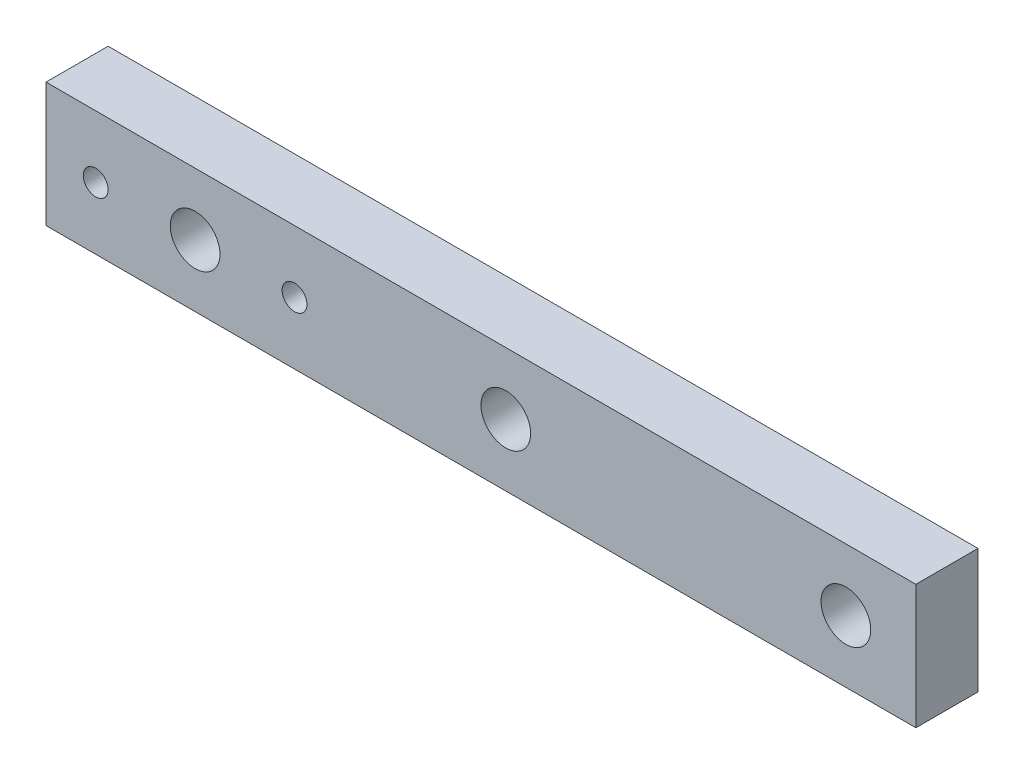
from build123d import *

# Parameters (mm, degrees)
SKETCH1_W           = 70
SKETCH1_H           = 10
BOSS_EXTRUDE1_DEPTH = 5
SKETCH2_R           = 1
SKETCH2_R_2         = 2
CUT_EXTRUDE1_DEPTH  = 5


with BuildPart() as part:
    # Sketch1 → Boss-Extrude1 (new body)
    with BuildSketch(Plane.XY):
        with Locations((2, 0)):
            Rectangle(SKETCH1_W, SKETCH1_H)
    extrude(amount=BOSS_EXTRUDE1_DEPTH)

    # Sketch2 → Cut-Extrude1 (cut)
    with BuildSketch(Plane.XY.offset(5)):
        with Locations((-29, 0)):
            Circle(SKETCH2_R)
        with Locations((-21, 0)):
            Circle(SKETCH2_R_2)
        with Locations((-13, 0)):
            Circle(SKETCH2_R)
        with Locations((4, 0)):
            Circle(SKETCH2_R_2)
        with Locations((31.367, 0)):
            Circle(SKETCH2_R_2)
    extrude(amount=-CUT_EXTRUDE1_DEPTH, mode=Mode.SUBTRACT)


solid = part.part
